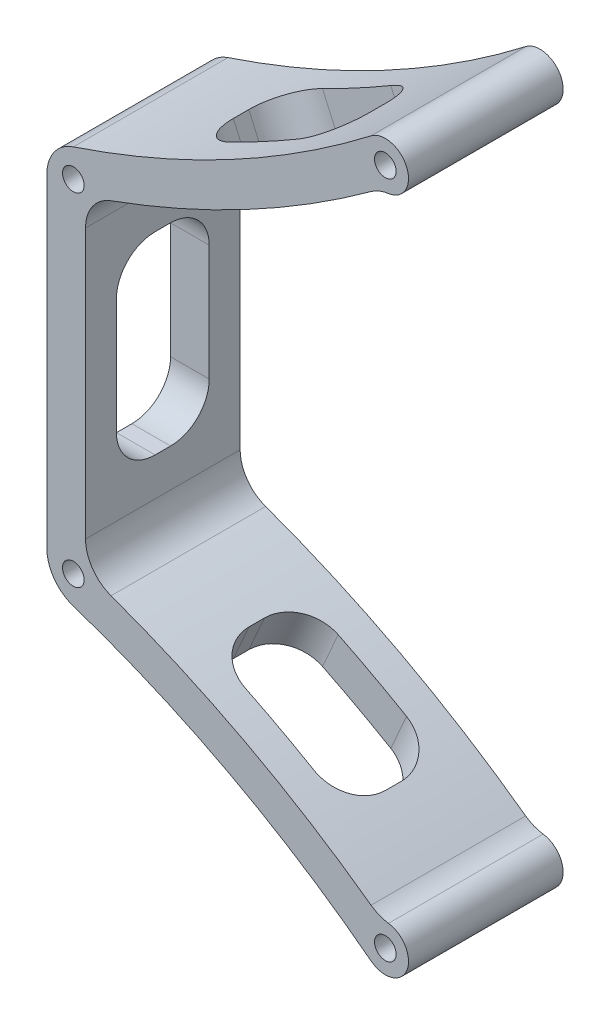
from build123d import *

# Parameters (mm, degrees)
EXTRUDE_1_DEPTH          = 20
FILLET_1_R               = 5
SKETCH_3_R               = 1.4
CUT_EXTRUDE_1_DEPTH      = 40
CUT_EXTRUDE_2_DEPTH      = 40
CUT_EXTRUDE_2_DEPTH_BACK = 40
SKETCH_4_W               = 12
SKETCH_4_H               = 25
FILLET_2_R               = 5
SKETCH_5_R               = 1.4
CUT_EXTRUDE_3_DEPTH      = 40
CUT_EXTRUDE_4_DEPTH      = 6
CUT_EXTRUDE_4_DEPTH_BACK = 6
FILLET_3_R               = 5


with BuildPart() as part:
    # Sketch 1 → Extrude 1 (new body)
    with BuildSketch(Plane.XY):
        with BuildLine():
            Line((-22.033449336, 34.20314744), (-22.033449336, 12.082486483))
            Line((-22.033449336, 12.082486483), (-22.033449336, -15.061932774))
            ThreePointArc((-22.033449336, -15.061932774), (-0.079104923, -23.954173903), (19.915080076, -36.654479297))
            ThreePointArc((19.915080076, -36.654479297), (24.665766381, -34.966971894), (21.170698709, -31.333625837))
            ThreePointArc((21.170698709, -31.333625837), (2.862844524, -19.847237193), (-17.033449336, -11.406138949))
            Line((-17.033449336, -11.406138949), (-17.033449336, 12.082486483))
            Line((-17.033449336, 12.082486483), (-17.033449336, 30.547353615))
            ThreePointArc((-17.033449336, 30.547353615), (2.862844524, 38.988451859), (21.170698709, 50.474840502))
            ThreePointArc((21.170698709, 50.474840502), (24.665766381, 54.10818656), (19.915080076, 55.795693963))
            ThreePointArc((19.915080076, 55.795693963), (-0.079104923, 43.095388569), (-22.033449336, 34.20314744))
        make_face()
    extrude(amount=EXTRUDE_1_DEPTH)

    # Fillet 1
    fillet_1_edges = [part.edges().sort_by_distance(p)[0] for p in [
        (21.170698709, -31.333625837, 10),
        (21.170698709, 50.474840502, 10),
    ]]
    fillet(fillet_1_edges, radius=FILLET_1_R)

    # Sketch 3 → Cut-Extrude 1 (cut)
    with BuildSketch(Plane.XY.offset(20)):
        with Locations((21.745962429, 53.419169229)):
            Circle(SKETCH_3_R)
        with Locations((21.745962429, -34.277954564)):
            Circle(SKETCH_3_R)
    extrude(amount=-CUT_EXTRUDE_1_DEPTH, mode=Mode.SUBTRACT)

    # Sketch 4 → Cut-Extrude 2 (cut, two sides: drawn at the far end of the back side and taken through both)
    with BuildSketch(Plane.ZY.offset(22.033449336).offset(-CUT_EXTRUDE_2_DEPTH_BACK)):
        with Locations((10, 9.570607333)):
            Rectangle(SKETCH_4_W, SKETCH_4_H)
    extrude(amount=CUT_EXTRUDE_2_DEPTH + CUT_EXTRUDE_2_DEPTH_BACK, mode=Mode.SUBTRACT)

    # Fillet 2
    fillet_2_edges = [part.edges().sort_by_distance(p)[0] for p in [
        (-22.033449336, -15.061932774, 10),
        (-22.033449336, 34.20314744, 10),
        (-17.033449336, 30.547353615, 10),
        (-17.033449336, -11.406138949, 10),
    ]]
    fillet(fillet_2_edges, radius=FILLET_2_R)

    # Sketch 5 → Cut-Extrude 3 (cut)
    with BuildSketch(Plane.XY.offset(20)):
        with Locations((-18.608178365, 31.667349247)):
            Circle(SKETCH_5_R)
        with Locations((-18.608178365, -12.526134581)):
            Circle(SKETCH_5_R)
    extrude(amount=-CUT_EXTRUDE_3_DEPTH, mode=Mode.SUBTRACT)

    # Sketch 6 → Cut-Extrude 4 (cut, two sides: drawn at the far end of the back side and taken through both)
    with BuildSketch(Plane.XY.offset(10).offset(-CUT_EXTRUDE_4_DEPTH_BACK)):
        with BuildLine():
            Line((-6.911280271, 39.824896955), (-4.883716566, 35.254449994))
            ThreePointArc((-4.883716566, 35.254449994), (4.13201992, 39.659004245), (12.798469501, 44.716301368))
            Line((12.798469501, 44.716301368), (10.747753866, 49.338936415))
            ThreePointArc((10.747753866, 49.338936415), (2.100604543, 44.243423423), (-6.911280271, 39.824896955))
        make_face()
        with BuildLine():
            Line((10.747753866, -30.19772175), (12.798469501, -25.575086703))
            ThreePointArc((12.798469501, -25.575086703), (4.13201992, -20.517789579), (-4.883716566, -16.113235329))
            Line((-4.883716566, -16.113235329), (-6.911280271, -20.68368229))
            ThreePointArc((-6.911280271, -20.68368229), (2.100604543, -25.102208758), (10.747753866, -30.19772175))
        make_face()
    extrude(amount=CUT_EXTRUDE_4_DEPTH + CUT_EXTRUDE_4_DEPTH_BACK, mode=Mode.SUBTRACT)

    # Fillet 3
    fillet_3_edges = [part.edges().sort_by_distance(p)[0] for p in [
        (11.773111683, 47.027618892, 4),
        (-5.897498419, 37.539673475, 4),
        (11.773111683, 47.027618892, 16),
        (-5.897498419, 37.539673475, 16),
        (11.773111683, -27.886404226, 4),
        (-5.897498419, -18.398458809, 4),
        (11.773111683, -27.886404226, 16),
        (-5.897498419, -18.398458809, 16),
        (-19.533449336, -2.929392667, 16),
        (-19.533449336, 22.070607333, 16),
        (-19.533449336, 22.070607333, 4),
        (-19.533449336, -2.929392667, 4),
    ]]
    fillet(fillet_3_edges, radius=FILLET_3_R)


solid = part.part
